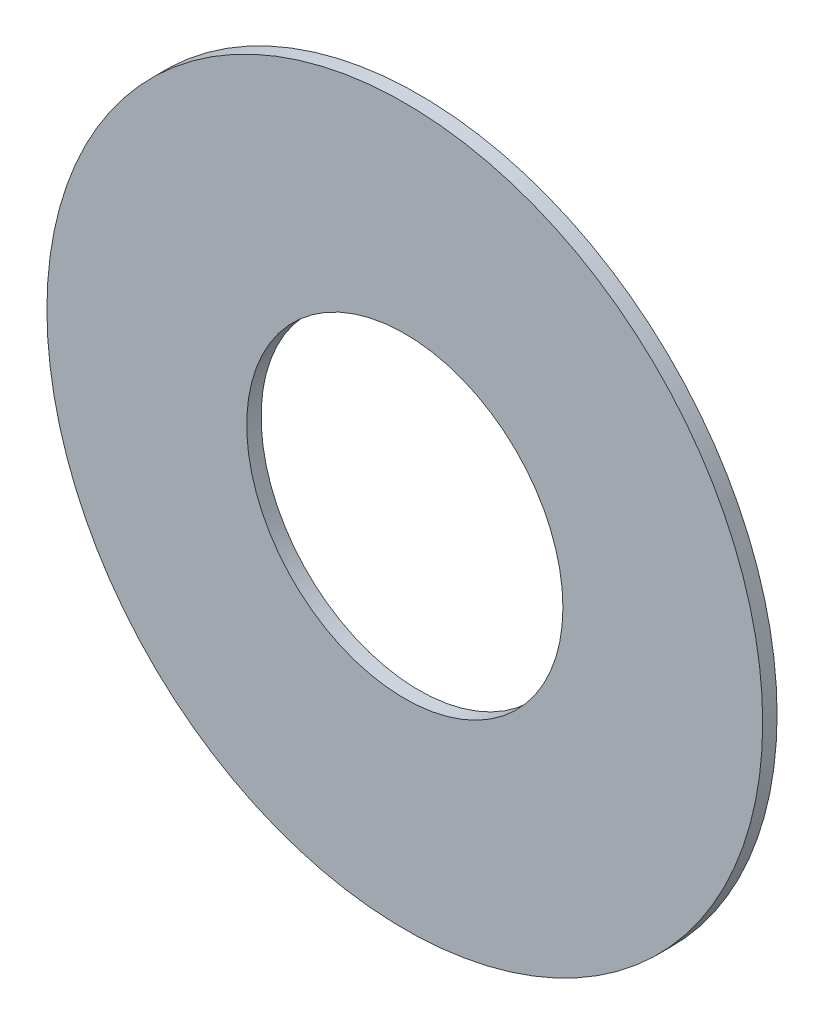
from build123d import *

# Parameters (mm, degrees)
ESQUISSE1_R      = 12.45
ESQUISSE1_R_2    = 5.5
EXTRUSION1_DEPTH = 0.5


with BuildPart() as part:
    # Esquisse1 → Extrusion1 (new body)
    with BuildSketch(Plane.XY):
        Circle(ESQUISSE1_R)
        Circle(ESQUISSE1_R_2, mode=Mode.SUBTRACT)
    extrude(amount=EXTRUSION1_DEPTH)


solid = part.part
